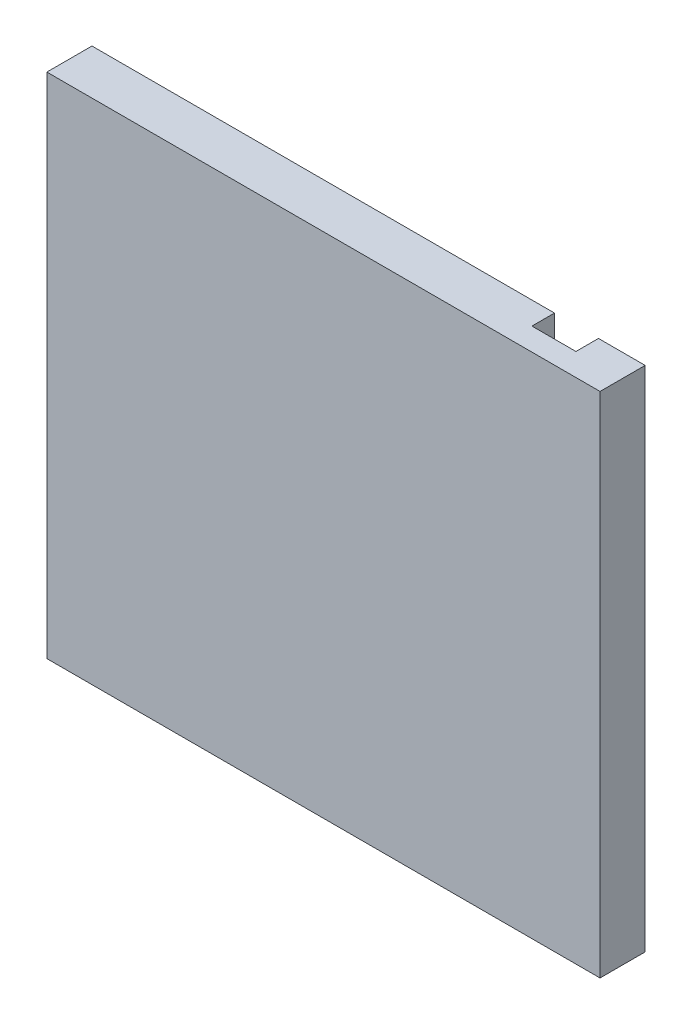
ISO-10303-21;
HEADER;
FILE_DESCRIPTION(('STEP AP214'),'2;1');
FILE_NAME('part.step','',(''),(''),'','','');
FILE_SCHEMA(('AUTOMOTIVE_DESIGN { 1 0 10303 214 1 1 1 1 }'));
ENDSEC;
DATA;
#1=APPLICATION_CONTEXT('core data for automotive mechanical design processes');
#2=APPLICATION_PROTOCOL_DEFINITION('international standard','automotive_design',2000,#1);
#3=PRODUCT_CONTEXT('',#1,'mechanical');
#4=PRODUCT('Part','Part','',(#3));
#5=PRODUCT_RELATED_PRODUCT_CATEGORY('part','',(#4));
#6=PRODUCT_DEFINITION_FORMATION('','',#4);
#7=PRODUCT_DEFINITION_CONTEXT('part definition',#1,'design');
#8=PRODUCT_DEFINITION('design','',#6,#7);
#9=PRODUCT_DEFINITION_SHAPE('','',#8);
#10=(LENGTH_UNIT() NAMED_UNIT(*) SI_UNIT(.MILLI.,.METRE.));
#11=(NAMED_UNIT(*) PLANE_ANGLE_UNIT() SI_UNIT($,.RADIAN.));
#12=(NAMED_UNIT(*) SI_UNIT($,.STERADIAN.) SOLID_ANGLE_UNIT());
#13=UNCERTAINTY_MEASURE_WITH_UNIT(LENGTH_MEASURE(1.E-05),#10,'distance_accuracy_value','');
#14=(GEOMETRIC_REPRESENTATION_CONTEXT(3) GLOBAL_UNCERTAINTY_ASSIGNED_CONTEXT((#13)) GLOBAL_UNIT_ASSIGNED_CONTEXT((#10,
#11,#12)) REPRESENTATION_CONTEXT('',''));
#15=CARTESIAN_POINT('',(0.,0.,0.));
#16=DIRECTION('',(0.,0.,1.));
#17=DIRECTION('',(1.,0.,0.));
#18=AXIS2_PLACEMENT_3D('',#15,#16,#17);
#19=CARTESIAN_POINT('',(0.,0.,3.6));
#20=DIRECTION('',(0.,0.,1.));
#21=DIRECTION('',(1.,0.,0.));
#22=AXIS2_PLACEMENT_3D('',#19,#20,#21);
#23=PLANE('',#22);
#24=DIRECTION('',(0.,-1.,0.));
#25=VECTOR('',#24,1.);
#26=CARTESIAN_POINT('',(-34.4,-64.95,3.6));
#27=LINE('',#26,#25);
#28=CARTESIAN_POINT('',(-34.4,-61.05,3.6));
#29=VERTEX_POINT('',#28);
#30=CARTESIAN_POINT('',(-34.4,-64.95,3.6));
#31=VERTEX_POINT('',#30);
#32=EDGE_CURVE('E318',#29,#31,#27,.T.);
#33=ORIENTED_EDGE('',*,*,#32,.T.);
#34=DIRECTION('',(-1.,0.,0.));
#35=VECTOR('',#34,1.);
#36=CARTESIAN_POINT('',(-36.2,-64.95,3.6));
#37=LINE('',#36,#35);
#38=CARTESIAN_POINT('',(-36.2,-64.95,3.6));
#39=VERTEX_POINT('',#38);
#40=EDGE_CURVE('E322',#31,#39,#37,.T.);
#41=ORIENTED_EDGE('',*,*,#40,.T.);
#42=DIRECTION('',(0.,-1.,0.));
#43=VECTOR('',#42,1.);
#44=CARTESIAN_POINT('',(-36.2,-65.1,3.6));
#45=LINE('',#44,#43);
#46=CARTESIAN_POINT('',(-36.2,-65.1,3.6));
#47=VERTEX_POINT('',#46);
#48=EDGE_CURVE('E323',#39,#47,#45,.T.);
#49=ORIENTED_EDGE('',*,*,#48,.T.);
#50=DIRECTION('',(-1.,0.,0.));
#51=VECTOR('',#50,1.);
#52=CARTESIAN_POINT('',(-39.4,-65.1,3.6));
#53=LINE('',#52,#51);
#54=CARTESIAN_POINT('',(-39.4,-65.1,3.6));
#55=VERTEX_POINT('',#54);
#56=EDGE_CURVE('E327',#47,#55,#53,.T.);
#57=ORIENTED_EDGE('',*,*,#56,.T.);
#58=DIRECTION('',(0.,1.,0.));
#59=VECTOR('',#58,1.);
#60=CARTESIAN_POINT('',(-39.4,-60.9,3.6));
#61=LINE('',#60,#59);
#62=CARTESIAN_POINT('',(-39.4,-60.9,3.6));
#63=VERTEX_POINT('',#62);
#64=EDGE_CURVE('E331',#55,#63,#61,.T.);
#65=ORIENTED_EDGE('',*,*,#64,.T.);
#66=DIRECTION('',(1.,0.,0.));
#67=VECTOR('',#66,1.);
#68=CARTESIAN_POINT('',(-36.2,-60.9,3.6));
#69=LINE('',#68,#67);
#70=CARTESIAN_POINT('',(-36.2,-60.9,3.6));
#71=VERTEX_POINT('',#70);
#72=EDGE_CURVE('E335',#63,#71,#69,.T.);
#73=ORIENTED_EDGE('',*,*,#72,.T.);
#74=DIRECTION('',(0.,-1.,0.));
#75=VECTOR('',#74,1.);
#76=CARTESIAN_POINT('',(-36.2,-61.05,3.6));
#77=LINE('',#76,#75);
#78=CARTESIAN_POINT('',(-36.2,-61.05,3.6));
#79=VERTEX_POINT('',#78);
#80=EDGE_CURVE('E339',#71,#79,#77,.T.);
#81=ORIENTED_EDGE('',*,*,#80,.T.);
#82=DIRECTION('',(1.,0.,0.));
#83=VECTOR('',#82,1.);
#84=CARTESIAN_POINT('',(-34.4,-61.05,3.6));
#85=LINE('',#84,#83);
#86=EDGE_CURVE('E343',#79,#29,#85,.T.);
#87=ORIENTED_EDGE('',*,*,#86,.T.);
#88=EDGE_LOOP('',(#33,#41,#49,#57,#65,#73,#81,#87));
#89=FACE_BOUND('',#88,.T.);
#90=ADVANCED_FACE('F48',(#89),#23,.F.);
#91=CARTESIAN_POINT('',(-36.2,-65.1,10.5299310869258));
#92=DIRECTION('',(1.,0.,0.));
#93=DIRECTION('',(0.,0.,-1.));
#94=AXIS2_PLACEMENT_3D('',#91,#92,#93);
#95=PLANE('',#94);
#96=DIRECTION('',(0.,0.,-1.));
#97=VECTOR('',#96,1.);
#98=CARTESIAN_POINT('',(-36.2,-64.95,10.5299310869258));
#99=LINE('',#98,#97);
#100=CARTESIAN_POINT('',(-36.2,-64.95,0.));
#101=VERTEX_POINT('',#100);
#102=EDGE_CURVE('E319',#39,#101,#99,.T.);
#103=ORIENTED_EDGE('',*,*,#102,.T.);
#104=DIRECTION('',(0.,-1.,0.));
#105=VECTOR('',#104,1.);
#106=CARTESIAN_POINT('',(-36.2,-65.1,0.));
#107=LINE('',#106,#105);
#108=CARTESIAN_POINT('',(-36.2,-65.1,0.));
#109=VERTEX_POINT('',#108);
#110=EDGE_CURVE('E376',#101,#109,#107,.T.);
#111=ORIENTED_EDGE('',*,*,#110,.T.);
#112=DIRECTION('',(0.,0.,-1.));
#113=VECTOR('',#112,1.);
#114=CARTESIAN_POINT('',(-36.2,-65.1,10.5299310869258));
#115=LINE('',#114,#113);
#116=EDGE_CURVE('E324',#47,#109,#115,.T.);
#117=ORIENTED_EDGE('',*,*,#116,.F.);
#118=ORIENTED_EDGE('',*,*,#48,.F.);
#119=EDGE_LOOP('',(#103,#111,#117,#118));
#120=FACE_BOUND('',#119,.T.);
#121=ADVANCED_FACE('F432',(#120),#95,.F.);
#122=CARTESIAN_POINT('',(-39.4,-65.1,10.5299310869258));
#123=DIRECTION('',(0.,-1.,0.));
#124=DIRECTION('',(0.,0.,-1.));
#125=AXIS2_PLACEMENT_3D('',#122,#123,#124);
#126=PLANE('',#125);
#127=ORIENTED_EDGE('',*,*,#116,.T.);
#128=DIRECTION('',(-1.,0.,0.));
#129=VECTOR('',#128,1.);
#130=CARTESIAN_POINT('',(-39.4,-65.1,0.));
#131=LINE('',#130,#129);
#132=CARTESIAN_POINT('',(-39.4,-65.1,0.));
#133=VERTEX_POINT('',#132);
#134=EDGE_CURVE('E380',#109,#133,#131,.T.);
#135=ORIENTED_EDGE('',*,*,#134,.T.);
#136=DIRECTION('',(0.,0.,-1.));
#137=VECTOR('',#136,1.);
#138=CARTESIAN_POINT('',(-39.4,-65.1,10.5299310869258));
#139=LINE('',#138,#137);
#140=EDGE_CURVE('E328',#55,#133,#139,.T.);
#141=ORIENTED_EDGE('',*,*,#140,.F.);
#142=ORIENTED_EDGE('',*,*,#56,.F.);
#143=EDGE_LOOP('',(#127,#135,#141,#142));
#144=FACE_BOUND('',#143,.T.);
#145=ADVANCED_FACE('F429',(#144),#126,.F.);
#146=CARTESIAN_POINT('',(-39.4,-60.9,10.5299310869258));
#147=DIRECTION('',(-1.,0.,0.));
#148=DIRECTION('',(0.,0.,1.));
#149=AXIS2_PLACEMENT_3D('',#146,#147,#148);
#150=PLANE('',#149);
#151=ORIENTED_EDGE('',*,*,#140,.T.);
#152=DIRECTION('',(0.,1.,0.));
#153=VECTOR('',#152,1.);
#154=CARTESIAN_POINT('',(-39.4,-60.9,0.));
#155=LINE('',#154,#153);
#156=CARTESIAN_POINT('',(-39.4,-60.9,0.));
#157=VERTEX_POINT('',#156);
#158=EDGE_CURVE('E384',#133,#157,#155,.T.);
#159=ORIENTED_EDGE('',*,*,#158,.T.);
#160=DIRECTION('',(0.,0.,-1.));
#161=VECTOR('',#160,1.);
#162=CARTESIAN_POINT('',(-39.4,-60.9,10.5299310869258));
#163=LINE('',#162,#161);
#164=EDGE_CURVE('E332',#63,#157,#163,.T.);
#165=ORIENTED_EDGE('',*,*,#164,.F.);
#166=ORIENTED_EDGE('',*,*,#64,.F.);
#167=EDGE_LOOP('',(#151,#159,#165,#166));
#168=FACE_BOUND('',#167,.T.);
#169=ADVANCED_FACE('F426',(#168),#150,.F.);
#170=CARTESIAN_POINT('',(-36.2,-60.9,10.5299310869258));
#171=DIRECTION('',(0.,1.,0.));
#172=DIRECTION('',(0.,0.,1.));
#173=AXIS2_PLACEMENT_3D('',#170,#171,#172);
#174=PLANE('',#173);
#175=ORIENTED_EDGE('',*,*,#164,.T.);
#176=DIRECTION('',(1.,0.,0.));
#177=VECTOR('',#176,1.);
#178=CARTESIAN_POINT('',(-36.2,-60.9,0.));
#179=LINE('',#178,#177);
#180=CARTESIAN_POINT('',(-36.2,-60.9,0.));
#181=VERTEX_POINT('',#180);
#182=EDGE_CURVE('E388',#157,#181,#179,.T.);
#183=ORIENTED_EDGE('',*,*,#182,.T.);
#184=DIRECTION('',(0.,0.,-1.));
#185=VECTOR('',#184,1.);
#186=CARTESIAN_POINT('',(-36.2,-60.9,10.5299310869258));
#187=LINE('',#186,#185);
#188=EDGE_CURVE('E336',#71,#181,#187,.T.);
#189=ORIENTED_EDGE('',*,*,#188,.F.);
#190=ORIENTED_EDGE('',*,*,#72,.F.);
#191=EDGE_LOOP('',(#175,#183,#189,#190));
#192=FACE_BOUND('',#191,.T.);
#193=ADVANCED_FACE('F420',(#192),#174,.F.);
#194=CARTESIAN_POINT('',(-36.2,-61.05,10.5299310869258));
#195=DIRECTION('',(1.,0.,0.));
#196=DIRECTION('',(0.,0.,-1.));
#197=AXIS2_PLACEMENT_3D('',#194,#195,#196);
#198=PLANE('',#197);
#199=ORIENTED_EDGE('',*,*,#188,.T.);
#200=DIRECTION('',(0.,-1.,0.));
#201=VECTOR('',#200,1.);
#202=CARTESIAN_POINT('',(-36.2,-61.05,0.));
#203=LINE('',#202,#201);
#204=CARTESIAN_POINT('',(-36.2,-61.05,0.));
#205=VERTEX_POINT('',#204);
#206=EDGE_CURVE('E392',#181,#205,#203,.T.);
#207=ORIENTED_EDGE('',*,*,#206,.T.);
#208=DIRECTION('',(0.,0.,-1.));
#209=VECTOR('',#208,1.);
#210=CARTESIAN_POINT('',(-36.2,-61.05,10.5299310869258));
#211=LINE('',#210,#209);
#212=EDGE_CURVE('E340',#79,#205,#211,.T.);
#213=ORIENTED_EDGE('',*,*,#212,.F.);
#214=ORIENTED_EDGE('',*,*,#80,.F.);
#215=EDGE_LOOP('',(#199,#207,#213,#214));
#216=FACE_BOUND('',#215,.T.);
#217=ADVANCED_FACE('F417',(#216),#198,.F.);
#218=CARTESIAN_POINT('',(-1.95,-39.7500000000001,2.));
#219=DIRECTION('',(-1.,0.,0.));
#220=DIRECTION('',(0.,-1.,0.));
#221=AXIS2_PLACEMENT_3D('',#218,#219,#220);
#222=PLANE('',#221);
#223=DIRECTION('',(0.,1.,0.));
#224=VECTOR('',#223,1.);
#225=CARTESIAN_POINT('',(-1.95,-39.7500000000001,0.));
#226=LINE('',#225,#224);
#227=CARTESIAN_POINT('',(-1.95000000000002,-61.05,0.));
#228=VERTEX_POINT('',#227);
#229=CARTESIAN_POINT('',(-1.95,-39.7500000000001,0.));
#230=VERTEX_POINT('',#229);
#231=EDGE_CURVE('E285',#228,#230,#226,.T.);
#232=ORIENTED_EDGE('',*,*,#231,.T.);
#233=DIRECTION('',(0.,0.,-1.));
#234=VECTOR('',#233,1.);
#235=CARTESIAN_POINT('',(-1.95,-39.7500000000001,2.));
#236=LINE('',#235,#234);
#237=CARTESIAN_POINT('',(-1.95,-39.7500000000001,2.));
#238=VERTEX_POINT('',#237);
#239=EDGE_CURVE('E297',#238,#230,#236,.T.);
#240=ORIENTED_EDGE('',*,*,#239,.F.);
#241=DIRECTION('',(0.,1.,0.));
#242=VECTOR('',#241,1.);
#243=CARTESIAN_POINT('',(-1.95,-39.7500000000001,2.));
#244=LINE('',#243,#242);
#245=CARTESIAN_POINT('',(-1.95000000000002,-61.05,2.));
#246=VERTEX_POINT('',#245);
#247=EDGE_CURVE('E267',#246,#238,#244,.T.);
#248=ORIENTED_EDGE('',*,*,#247,.F.);
#249=DIRECTION('',(0.,0.,-1.));
#250=VECTOR('',#249,1.);
#251=CARTESIAN_POINT('',(-1.95000000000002,-61.05,2.));
#252=LINE('',#251,#250);
#253=EDGE_CURVE('E301',#246,#228,#252,.T.);
#254=ORIENTED_EDGE('',*,*,#253,.T.);
#255=EDGE_LOOP('',(#232,#240,#248,#254));
#256=FACE_BOUND('',#255,.T.);
#257=ADVANCED_FACE('F407',(#256),#222,.F.);
#258=CARTESIAN_POINT('',(-34.4,-61.05,10.5299310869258));
#259=DIRECTION('',(0.,1.,0.));
#260=DIRECTION('',(-1.,0.,0.));
#261=AXIS2_PLACEMENT_3D('',#258,#259,#260);
#262=PLANE('',#261);
#263=ORIENTED_EDGE('',*,*,#212,.T.);
#264=DIRECTION('',(1.,0.,0.));
#265=VECTOR('',#264,1.);
#266=CARTESIAN_POINT('',(-34.4,-61.05,0.));
#267=LINE('',#266,#265);
#268=EDGE_CURVE('E372',#205,#228,#267,.T.);
#269=ORIENTED_EDGE('',*,*,#268,.T.);
#270=ORIENTED_EDGE('',*,*,#253,.F.);
#271=DIRECTION('',(1.,0.,0.));
#272=VECTOR('',#271,1.);
#273=CARTESIAN_POINT('',(-34.4,-61.05,2.));
#274=LINE('',#273,#272);
#275=CARTESIAN_POINT('',(-34.4,-61.05,2.));
#276=VERTEX_POINT('',#275);
#277=EDGE_CURVE('E263',#276,#246,#274,.T.);
#278=ORIENTED_EDGE('',*,*,#277,.F.);
#279=DIRECTION('',(0.,0.,-1.));
#280=VECTOR('',#279,1.);
#281=CARTESIAN_POINT('',(-34.4,-61.05,10.5299310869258));
#282=LINE('',#281,#280);
#283=EDGE_CURVE('E344',#29,#276,#282,.T.);
#284=ORIENTED_EDGE('',*,*,#283,.F.);
#285=ORIENTED_EDGE('',*,*,#86,.F.);
#286=EDGE_LOOP('',(#263,#269,#270,#278,#284,#285));
#287=FACE_BOUND('',#286,.T.);
#288=ADVANCED_FACE('F413',(#287),#262,.F.);
#289=CARTESIAN_POINT('',(-34.4,-64.95,10.5299310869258));
#290=DIRECTION('',(1.,0.,0.));
#291=DIRECTION('',(0.,0.,-1.));
#292=AXIS2_PLACEMENT_3D('',#289,#290,#291);
#293=PLANE('',#292);
#294=ORIENTED_EDGE('',*,*,#283,.T.);
#295=DIRECTION('',(0.,1.,0.));
#296=VECTOR('',#295,1.);
#297=CARTESIAN_POINT('',(-34.4,-64.95,2.));
#298=LINE('',#297,#296);
#299=CARTESIAN_POINT('',(-34.4,-64.95,2.));
#300=VERTEX_POINT('',#299);
#301=EDGE_CURVE('E259',#300,#276,#298,.T.);
#302=ORIENTED_EDGE('',*,*,#301,.F.);
#303=DIRECTION('',(0.,0.,-1.));
#304=VECTOR('',#303,1.);
#305=CARTESIAN_POINT('',(-34.4,-64.95,10.5299310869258));
#306=LINE('',#305,#304);
#307=EDGE_CURVE('E296',#31,#300,#306,.T.);
#308=ORIENTED_EDGE('',*,*,#307,.F.);
#309=ORIENTED_EDGE('',*,*,#32,.F.);
#310=EDGE_LOOP('',(#294,#302,#308,#309));
#311=FACE_BOUND('',#310,.T.);
#312=ADVANCED_FACE('F475',(#311),#293,.F.);
#313=CARTESIAN_POINT('',(-36.2,-64.95,10.5299310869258));
#314=DIRECTION('',(0.,-1.,0.));
#315=DIRECTION('',(1.,0.,0.));
#316=AXIS2_PLACEMENT_3D('',#313,#314,#315);
#317=PLANE('',#316);
#318=ORIENTED_EDGE('',*,*,#307,.T.);
#319=DIRECTION('',(-1.,0.,0.));
#320=VECTOR('',#319,1.);
#321=CARTESIAN_POINT('',(1.94999999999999,-64.95,2.));
#322=LINE('',#321,#320);
#323=CARTESIAN_POINT('',(1.94999999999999,-64.95,2.));
#324=VERTEX_POINT('',#323);
#325=EDGE_CURVE('E255',#324,#300,#322,.T.);
#326=ORIENTED_EDGE('',*,*,#325,.F.);
#327=DIRECTION('',(0.,0.,-1.));
#328=VECTOR('',#327,1.);
#329=CARTESIAN_POINT('',(1.94999999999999,-64.95,2.));
#330=LINE('',#329,#328);
#331=CARTESIAN_POINT('',(1.94999999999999,-64.95,0.));
#332=VERTEX_POINT('',#331);
#333=EDGE_CURVE('E282',#324,#332,#330,.T.);
#334=ORIENTED_EDGE('',*,*,#333,.T.);
#335=DIRECTION('',(-1.,0.,0.));
#336=VECTOR('',#335,1.);
#337=CARTESIAN_POINT('',(-36.2,-64.95,0.));
#338=LINE('',#337,#336);
#339=EDGE_CURVE('E314',#332,#101,#338,.T.);
#340=ORIENTED_EDGE('',*,*,#339,.T.);
#341=ORIENTED_EDGE('',*,*,#102,.F.);
#342=ORIENTED_EDGE('',*,*,#40,.F.);
#343=EDGE_LOOP('',(#318,#326,#334,#340,#341,#342));
#344=FACE_BOUND('',#343,.T.);
#345=ADVANCED_FACE('F439',(#344),#317,.F.);
#346=CARTESIAN_POINT('',(0.,0.,2.));
#347=DIRECTION('',(0.,0.,1.));
#348=DIRECTION('',(1.,0.,0.));
#349=AXIS2_PLACEMENT_3D('',#346,#347,#348);
#350=PLANE('',#349);
#351=DIRECTION('',(-1.,0.,0.));
#352=VECTOR('',#351,1.);
#353=CARTESIAN_POINT('',(0.,-28.7517381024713,2.));
#354=LINE('',#353,#352);
#355=CARTESIAN_POINT('',(1.94999999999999,-28.7517381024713,2.));
#356=VERTEX_POINT('',#355);
#357=CARTESIAN_POINT('',(-1.95000000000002,-28.7517381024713,2.));
#358=VERTEX_POINT('',#357);
#359=EDGE_CURVE('E13',#356,#358,#354,.T.);
#360=ORIENTED_EDGE('',*,*,#359,.F.);
#361=DIRECTION('',(0.,-1.,0.));
#362=VECTOR('',#361,1.);
#363=CARTESIAN_POINT('',(1.95,-14.55,2.));
#364=LINE('',#363,#362);
#365=EDGE_CURVE('E252',#356,#324,#364,.T.);
#366=ORIENTED_EDGE('',*,*,#365,.T.);
#367=ORIENTED_EDGE('',*,*,#325,.T.);
#368=ORIENTED_EDGE('',*,*,#301,.T.);
#369=ORIENTED_EDGE('',*,*,#277,.T.);
#370=ORIENTED_EDGE('',*,*,#247,.T.);
#371=DIRECTION('',(-1.,0.,0.));
#372=VECTOR('',#371,1.);
#373=CARTESIAN_POINT('',(-59.6,-39.7500000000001,2.));
#374=LINE('',#373,#372);
#375=CARTESIAN_POINT('',(-42.9516900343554,-39.7500000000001,2.));
#376=VERTEX_POINT('',#375);
#377=EDGE_CURVE('E271',#238,#376,#374,.T.);
#378=ORIENTED_EDGE('',*,*,#377,.T.);
#379=DIRECTION('',(0.,-1.,0.));
#380=VECTOR('',#379,1.);
#381=CARTESIAN_POINT('',(-42.9516900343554,0.,2.));
#382=LINE('',#381,#380);
#383=CARTESIAN_POINT('',(-42.9516900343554,-35.8500000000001,2.));
#384=VERTEX_POINT('',#383);
#385=EDGE_CURVE('E57',#384,#376,#382,.T.);
#386=ORIENTED_EDGE('',*,*,#385,.F.);
#387=DIRECTION('',(1.,0.,0.));
#388=VECTOR('',#387,1.);
#389=CARTESIAN_POINT('',(-59.6,-35.8500000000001,2.));
#390=LINE('',#389,#388);
#391=CARTESIAN_POINT('',(-1.95000000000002,-35.8500000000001,2.));
#392=VERTEX_POINT('',#391);
#393=EDGE_CURVE('E275',#384,#392,#390,.T.);
#394=ORIENTED_EDGE('',*,*,#393,.T.);
#395=DIRECTION('',(0.,1.,0.));
#396=VECTOR('',#395,1.);
#397=CARTESIAN_POINT('',(-1.95000000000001,10.65,2.));
#398=LINE('',#397,#396);
#399=EDGE_CURVE('E278',#392,#358,#398,.T.);
#400=ORIENTED_EDGE('',*,*,#399,.T.);
#401=EDGE_LOOP('',(#360,#366,#367,#368,#369,#370,#378,#386,#394,#400));
#402=FACE_BOUND('',#401,.T.);
#403=ADVANCED_FACE('F404',(#402),#350,.F.);
#404=CARTESIAN_POINT('',(1.95,-14.55,2.));
#405=DIRECTION('',(1.,0.,0.));
#406=DIRECTION('',(0.,1.,0.));
#407=AXIS2_PLACEMENT_3D('',#404,#405,#406);
#408=PLANE('',#407);
#409=DIRECTION('',(0.,0.,1.));
#410=VECTOR('',#409,1.);
#411=CARTESIAN_POINT('',(1.95,-28.7517381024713,2.));
#412=LINE('',#411,#410);
#413=CARTESIAN_POINT('',(1.95,-28.7517381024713,0.));
#414=VERTEX_POINT('',#413);
#415=EDGE_CURVE('E235',#414,#356,#412,.T.);
#416=ORIENTED_EDGE('',*,*,#415,.F.);
#417=DIRECTION('',(0.,-1.,0.));
#418=VECTOR('',#417,1.);
#419=CARTESIAN_POINT('',(1.95,-14.55,0.));
#420=LINE('',#419,#418);
#421=EDGE_CURVE('E251',#414,#332,#420,.T.);
#422=ORIENTED_EDGE('',*,*,#421,.T.);
#423=ORIENTED_EDGE('',*,*,#333,.F.);
#424=ORIENTED_EDGE('',*,*,#365,.F.);
#425=EDGE_LOOP('',(#416,#422,#423,#424));
#426=FACE_BOUND('',#425,.T.);
#427=ADVANCED_FACE('F443',(#426),#408,.F.);
#428=CARTESIAN_POINT('',(-1.95000000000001,10.65,2.));
#429=DIRECTION('',(-1.,0.,0.));
#430=DIRECTION('',(0.,-1.,0.));
#431=AXIS2_PLACEMENT_3D('',#428,#429,#430);
#432=PLANE('',#431);
#433=DIRECTION('',(0.,0.,-1.));
#434=VECTOR('',#433,1.);
#435=CARTESIAN_POINT('',(-1.95000000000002,-28.7517381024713,2.));
#436=LINE('',#435,#434);
#437=CARTESIAN_POINT('',(-1.95000000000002,-28.7517381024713,0.));
#438=VERTEX_POINT('',#437);
#439=EDGE_CURVE('E238',#358,#438,#436,.T.);
#440=ORIENTED_EDGE('',*,*,#439,.F.);
#441=ORIENTED_EDGE('',*,*,#399,.F.);
#442=DIRECTION('',(0.,0.,-1.));
#443=VECTOR('',#442,1.);
#444=CARTESIAN_POINT('',(-1.95000000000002,-35.8500000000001,2.));
#445=LINE('',#444,#443);
#446=CARTESIAN_POINT('',(-1.95000000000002,-35.8500000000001,0.));
#447=VERTEX_POINT('',#446);
#448=EDGE_CURVE('E292',#392,#447,#445,.T.);
#449=ORIENTED_EDGE('',*,*,#448,.T.);
#450=DIRECTION('',(0.,1.,0.));
#451=VECTOR('',#450,1.);
#452=CARTESIAN_POINT('',(-1.95000000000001,10.65,0.));
#453=LINE('',#452,#451);
#454=EDGE_CURVE('E256',#447,#438,#453,.T.);
#455=ORIENTED_EDGE('',*,*,#454,.T.);
#456=EDGE_LOOP('',(#440,#441,#449,#455));
#457=FACE_BOUND('',#456,.T.);
#458=ADVANCED_FACE('F450',(#457),#432,.F.);
#459=CARTESIAN_POINT('',(-59.6,-35.8500000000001,10.5299310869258));
#460=DIRECTION('',(0.,1.,0.));
#461=DIRECTION('',(0.,0.,1.));
#462=AXIS2_PLACEMENT_3D('',#459,#460,#461);
#463=PLANE('',#462);
#464=DIRECTION('',(0.,0.,1.));
#465=VECTOR('',#464,1.);
#466=CARTESIAN_POINT('',(-42.9516900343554,-35.8500000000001,10.5299310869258));
#467=LINE('',#466,#465);
#468=CARTESIAN_POINT('',(-42.9516900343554,-35.8500000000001,0.));
#469=VERTEX_POINT('',#468);
#470=EDGE_CURVE('E72',#469,#384,#467,.T.);
#471=ORIENTED_EDGE('',*,*,#470,.F.);
#472=DIRECTION('',(1.,0.,0.));
#473=VECTOR('',#472,1.);
#474=CARTESIAN_POINT('',(-59.6,-35.8500000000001,0.));
#475=LINE('',#474,#473);
#476=EDGE_CURVE('E311',#469,#447,#475,.T.);
#477=ORIENTED_EDGE('',*,*,#476,.T.);
#478=ORIENTED_EDGE('',*,*,#448,.F.);
#479=ORIENTED_EDGE('',*,*,#393,.F.);
#480=EDGE_LOOP('',(#471,#477,#478,#479));
#481=FACE_BOUND('',#480,.T.);
#482=ADVANCED_FACE('F457',(#481),#463,.F.);
#483=CARTESIAN_POINT('',(-61.4,-39.7500000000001,10.5299310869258));
#484=DIRECTION('',(0.,-1.,0.));
#485=DIRECTION('',(0.,0.,-1.));
#486=AXIS2_PLACEMENT_3D('',#483,#484,#485);
#487=PLANE('',#486);
#488=DIRECTION('',(0.,0.,-1.));
#489=VECTOR('',#488,1.);
#490=CARTESIAN_POINT('',(-42.9516900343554,-39.7500000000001,10.5299310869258));
#491=LINE('',#490,#489);
#492=CARTESIAN_POINT('',(-42.9516900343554,-39.7500000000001,0.));
#493=VERTEX_POINT('',#492);
#494=EDGE_CURVE('E199',#376,#493,#491,.T.);
#495=ORIENTED_EDGE('',*,*,#494,.F.);
#496=ORIENTED_EDGE('',*,*,#377,.F.);
#497=ORIENTED_EDGE('',*,*,#239,.T.);
#498=DIRECTION('',(-1.,0.,0.));
#499=VECTOR('',#498,1.);
#500=CARTESIAN_POINT('',(-61.4,-39.7500000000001,0.));
#501=LINE('',#500,#499);
#502=EDGE_CURVE('E308',#230,#493,#501,.T.);
#503=ORIENTED_EDGE('',*,*,#502,.T.);
#504=EDGE_LOOP('',(#495,#496,#497,#503));
#505=FACE_BOUND('',#504,.T.);
#506=ADVANCED_FACE('F402',(#505),#487,.F.);
#507=CARTESIAN_POINT('',(0.,0.,0.));
#508=DIRECTION('',(0.,0.,1.));
#509=DIRECTION('',(1.,0.,0.));
#510=AXIS2_PLACEMENT_3D('',#507,#508,#509);
#511=PLANE('',#510);
#512=DIRECTION('',(1.,0.,0.));
#513=VECTOR('',#512,1.);
#514=CARTESIAN_POINT('',(6.08692822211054,-28.7517381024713,0.));
#515=LINE('',#514,#513);
#516=CARTESIAN_POINT('',(6.08692822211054,-28.7517381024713,0.));
#517=VERTEX_POINT('',#516);
#518=EDGE_CURVE('E203',#414,#517,#515,.T.);
#519=ORIENTED_EDGE('',*,*,#518,.T.);
#520=DIRECTION('',(0.,-1.,0.));
#521=VECTOR('',#520,1.);
#522=CARTESIAN_POINT('',(6.08692822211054,-28.7517381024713,0.));
#523=LINE('',#522,#521);
#524=CARTESIAN_POINT('',(6.08692822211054,-73.7833489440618,0.));
#525=VERTEX_POINT('',#524);
#526=EDGE_CURVE('E209',#517,#525,#523,.T.);
#527=ORIENTED_EDGE('',*,*,#526,.T.);
#528=DIRECTION('',(-1.,0.,0.));
#529=VECTOR('',#528,1.);
#530=CARTESIAN_POINT('',(6.08692822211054,-73.7833489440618,0.));
#531=LINE('',#530,#529);
#532=CARTESIAN_POINT('',(-42.9516900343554,-73.7833489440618,0.));
#533=VERTEX_POINT('',#532);
#534=EDGE_CURVE('E187',#525,#533,#531,.T.);
#535=ORIENTED_EDGE('',*,*,#534,.T.);
#536=DIRECTION('',(0.,1.,0.));
#537=VECTOR('',#536,1.);
#538=CARTESIAN_POINT('',(-42.9516900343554,-28.7517381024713,0.));
#539=LINE('',#538,#537);
#540=EDGE_CURVE('E196',#533,#493,#539,.T.);
#541=ORIENTED_EDGE('',*,*,#540,.T.);
#542=ORIENTED_EDGE('',*,*,#502,.F.);
#543=ORIENTED_EDGE('',*,*,#231,.F.);
#544=ORIENTED_EDGE('',*,*,#268,.F.);
#545=ORIENTED_EDGE('',*,*,#206,.F.);
#546=ORIENTED_EDGE('',*,*,#182,.F.);
#547=ORIENTED_EDGE('',*,*,#158,.F.);
#548=ORIENTED_EDGE('',*,*,#134,.F.);
#549=ORIENTED_EDGE('',*,*,#110,.F.);
#550=ORIENTED_EDGE('',*,*,#339,.F.);
#551=ORIENTED_EDGE('',*,*,#421,.F.);
#552=EDGE_LOOP('',(#519,#527,#535,#541,#542,#543,#544,#545,#546,#547,#548,#549,#550,#551));
#553=FACE_BOUND('',#552,.T.);
#554=ADVANCED_FACE('F207',(#553),#511,.F.);
#555=CARTESIAN_POINT('',(-42.9516900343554,-28.7517381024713,0.));
#556=VERTEX_POINT('',#555);
#557=EDGE_CURVE('E217',#556,#438,#515,.T.);
#558=ORIENTED_EDGE('',*,*,#557,.T.);
#559=ORIENTED_EDGE('',*,*,#454,.F.);
#560=ORIENTED_EDGE('',*,*,#476,.F.);
#561=EDGE_CURVE('E204',#469,#556,#539,.T.);
#562=ORIENTED_EDGE('',*,*,#561,.T.);
#563=EDGE_LOOP('',(#558,#559,#560,#562));
#564=FACE_BOUND('',#563,.T.);
#565=ADVANCED_FACE('F50',(#564),#511,.F.);
#566=CARTESIAN_POINT('',(6.08692822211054,-28.7517381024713,10.));
#567=DIRECTION('',(0.,1.,0.));
#568=DIRECTION('',(0.,0.,1.));
#569=AXIS2_PLACEMENT_3D('',#566,#567,#568);
#570=PLANE('',#569);
#571=DIRECTION('',(0.,0.,-1.));
#572=VECTOR('',#571,1.);
#573=CARTESIAN_POINT('',(6.08692822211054,-28.7517381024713,10.));
#574=LINE('',#573,#572);
#575=CARTESIAN_POINT('',(6.08692822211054,-28.7517381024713,4.));
#576=VERTEX_POINT('',#575);
#577=EDGE_CURVE('E221',#576,#517,#574,.T.);
#578=ORIENTED_EDGE('',*,*,#577,.T.);
#579=ORIENTED_EDGE('',*,*,#518,.F.);
#580=ORIENTED_EDGE('',*,*,#415,.T.);
#581=ORIENTED_EDGE('',*,*,#359,.T.);
#582=ORIENTED_EDGE('',*,*,#439,.T.);
#583=ORIENTED_EDGE('',*,*,#557,.F.);
#584=DIRECTION('',(0.,0.,-1.));
#585=VECTOR('',#584,1.);
#586=CARTESIAN_POINT('',(-42.9516900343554,-28.7517381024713,10.));
#587=LINE('',#586,#585);
#588=CARTESIAN_POINT('',(-42.9516900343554,-28.7517381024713,4.));
#589=VERTEX_POINT('',#588);
#590=EDGE_CURVE('E193',#589,#556,#587,.T.);
#591=ORIENTED_EDGE('',*,*,#590,.F.);
#592=DIRECTION('',(-1.,0.,0.));
#593=VECTOR('',#592,1.);
#594=CARTESIAN_POINT('',(0.,-28.7517381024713,4.));
#595=LINE('',#594,#593);
#596=EDGE_CURVE('E241',#576,#589,#595,.T.);
#597=ORIENTED_EDGE('',*,*,#596,.F.);
#598=EDGE_LOOP('',(#578,#579,#580,#581,#582,#583,#591,#597));
#599=FACE_BOUND('',#598,.T.);
#600=ADVANCED_FACE('F445',(#599),#570,.T.);
#601=CARTESIAN_POINT('',(-42.9516900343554,-28.7517381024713,10.));
#602=DIRECTION('',(-1.,0.,0.));
#603=DIRECTION('',(0.,0.,1.));
#604=AXIS2_PLACEMENT_3D('',#601,#602,#603);
#605=PLANE('',#604);
#606=ORIENTED_EDGE('',*,*,#590,.T.);
#607=ORIENTED_EDGE('',*,*,#561,.F.);
#608=ORIENTED_EDGE('',*,*,#470,.T.);
#609=ORIENTED_EDGE('',*,*,#385,.T.);
#610=ORIENTED_EDGE('',*,*,#494,.T.);
#611=ORIENTED_EDGE('',*,*,#540,.F.);
#612=DIRECTION('',(0.,0.,-1.));
#613=VECTOR('',#612,1.);
#614=CARTESIAN_POINT('',(-42.9516900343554,-73.7833489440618,10.));
#615=LINE('',#614,#613);
#616=CARTESIAN_POINT('',(-42.9516900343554,-73.7833489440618,4.));
#617=VERTEX_POINT('',#616);
#618=EDGE_CURVE('E183',#617,#533,#615,.T.);
#619=ORIENTED_EDGE('',*,*,#618,.F.);
#620=DIRECTION('',(0.,-1.,0.));
#621=VECTOR('',#620,1.);
#622=CARTESIAN_POINT('',(-42.9516900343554,0.,4.));
#623=LINE('',#622,#621);
#624=EDGE_CURVE('E232',#589,#617,#623,.T.);
#625=ORIENTED_EDGE('',*,*,#624,.F.);
#626=EDGE_LOOP('',(#606,#607,#608,#609,#610,#611,#619,#625));
#627=FACE_BOUND('',#626,.T.);
#628=ADVANCED_FACE('F197',(#627),#605,.T.);
#629=CARTESIAN_POINT('',(6.08692822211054,-28.7517381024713,10.));
#630=DIRECTION('',(1.,0.,0.));
#631=DIRECTION('',(0.,1.,0.));
#632=AXIS2_PLACEMENT_3D('',#629,#630,#631);
#633=PLANE('',#632);
#634=DIRECTION('',(0.,0.,-1.));
#635=VECTOR('',#634,1.);
#636=CARTESIAN_POINT('',(6.08692822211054,-73.7833489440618,10.));
#637=LINE('',#636,#635);
#638=CARTESIAN_POINT('',(6.08692822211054,-73.7833489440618,4.));
#639=VERTEX_POINT('',#638);
#640=EDGE_CURVE('E64',#639,#525,#637,.T.);
#641=ORIENTED_EDGE('',*,*,#640,.T.);
#642=ORIENTED_EDGE('',*,*,#526,.F.);
#643=ORIENTED_EDGE('',*,*,#577,.F.);
#644=DIRECTION('',(0.,1.,0.));
#645=VECTOR('',#644,1.);
#646=CARTESIAN_POINT('',(6.08692822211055,0.,4.));
#647=LINE('',#646,#645);
#648=EDGE_CURVE('E247',#639,#576,#647,.T.);
#649=ORIENTED_EDGE('',*,*,#648,.F.);
#650=EDGE_LOOP('',(#641,#642,#643,#649));
#651=FACE_BOUND('',#650,.T.);
#652=ADVANCED_FACE('F495',(#651),#633,.T.);
#653=CARTESIAN_POINT('',(6.08692822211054,-73.7833489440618,10.));
#654=DIRECTION('',(0.,-1.,0.));
#655=DIRECTION('',(0.,0.,-1.));
#656=AXIS2_PLACEMENT_3D('',#653,#654,#655);
#657=PLANE('',#656);
#658=ORIENTED_EDGE('',*,*,#618,.T.);
#659=ORIENTED_EDGE('',*,*,#534,.F.);
#660=ORIENTED_EDGE('',*,*,#640,.F.);
#661=DIRECTION('',(1.,0.,0.));
#662=VECTOR('',#661,1.);
#663=CARTESIAN_POINT('',(0.,-73.7833489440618,4.));
#664=LINE('',#663,#662);
#665=EDGE_CURVE('E190',#617,#639,#664,.T.);
#666=ORIENTED_EDGE('',*,*,#665,.F.);
#667=EDGE_LOOP('',(#658,#659,#660,#666));
#668=FACE_BOUND('',#667,.T.);
#669=ADVANCED_FACE('F185',(#668),#657,.T.);
#670=CARTESIAN_POINT('',(0.,0.,4.));
#671=DIRECTION('',(0.,0.,1.));
#672=DIRECTION('',(1.,0.,0.));
#673=AXIS2_PLACEMENT_3D('',#670,#671,#672);
#674=PLANE('',#673);
#675=ORIENTED_EDGE('',*,*,#665,.T.);
#676=ORIENTED_EDGE('',*,*,#648,.T.);
#677=ORIENTED_EDGE('',*,*,#596,.T.);
#678=ORIENTED_EDGE('',*,*,#624,.T.);
#679=EDGE_LOOP('',(#675,#676,#677,#678));
#680=FACE_BOUND('',#679,.T.);
#681=ADVANCED_FACE('F489',(#680),#674,.T.);
#682=CLOSED_SHELL('',(#90,#121,#145,#169,#193,#217,#257,#288,#312,#345,#403,#427,#458,#482,#506,
#554,#565,#600,#628,#652,#669,#681));
#683=MANIFOLD_SOLID_BREP('B2',#682);
#684=ADVANCED_BREP_SHAPE_REPRESENTATION('',(#18,#683),#14);
#685=SHAPE_DEFINITION_REPRESENTATION(#9,#684);
ENDSEC;
END-ISO-10303-21;
